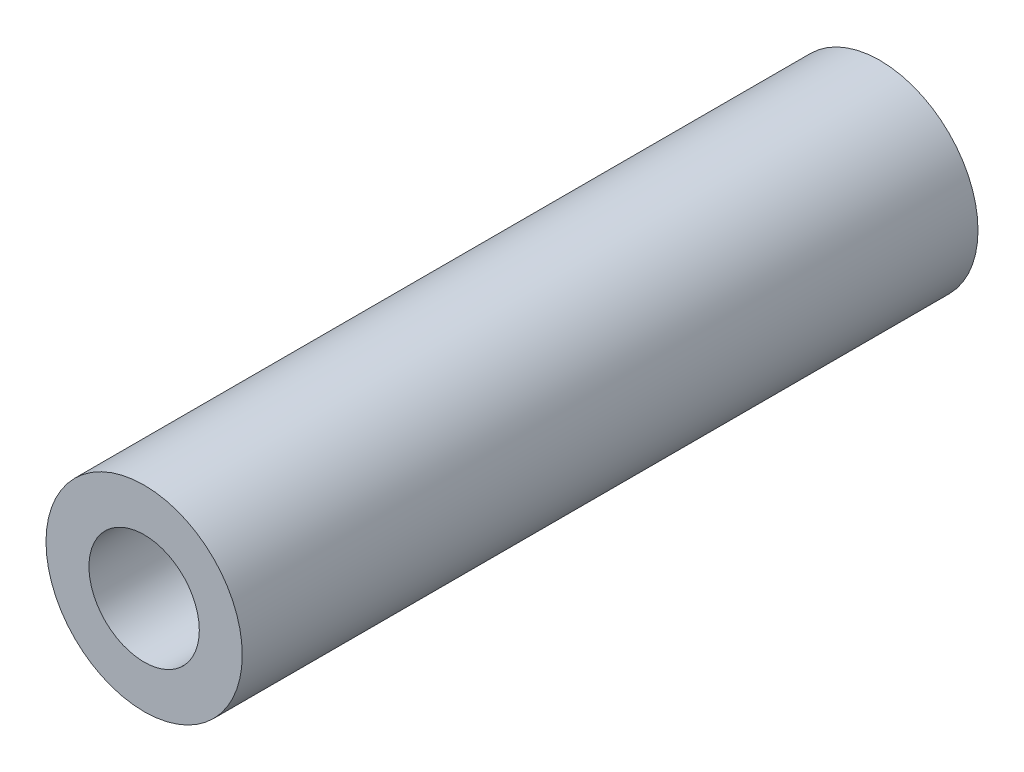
ISO-10303-21;
HEADER;
FILE_DESCRIPTION(('STEP AP214'),'2;1');
FILE_NAME('part.step','',(''),(''),'','','');
FILE_SCHEMA(('AUTOMOTIVE_DESIGN { 1 0 10303 214 1 1 1 1 }'));
ENDSEC;
DATA;
#1=APPLICATION_CONTEXT('core data for automotive mechanical design processes');
#2=APPLICATION_PROTOCOL_DEFINITION('international standard','automotive_design',2000,#1);
#3=PRODUCT_CONTEXT('',#1,'mechanical');
#4=PRODUCT('Part','Part','',(#3));
#5=PRODUCT_RELATED_PRODUCT_CATEGORY('part','',(#4));
#6=PRODUCT_DEFINITION_FORMATION('','',#4);
#7=PRODUCT_DEFINITION_CONTEXT('part definition',#1,'design');
#8=PRODUCT_DEFINITION('design','',#6,#7);
#9=PRODUCT_DEFINITION_SHAPE('','',#8);
#10=(LENGTH_UNIT() NAMED_UNIT(*) SI_UNIT(.MILLI.,.METRE.));
#11=(NAMED_UNIT(*) PLANE_ANGLE_UNIT() SI_UNIT($,.RADIAN.));
#12=(NAMED_UNIT(*) SI_UNIT($,.STERADIAN.) SOLID_ANGLE_UNIT());
#13=UNCERTAINTY_MEASURE_WITH_UNIT(LENGTH_MEASURE(1.E-05),#10,'distance_accuracy_value','');
#14=(GEOMETRIC_REPRESENTATION_CONTEXT(3) GLOBAL_UNCERTAINTY_ASSIGNED_CONTEXT((#13)) GLOBAL_UNIT_ASSIGNED_CONTEXT((#10,
#11,#12)) REPRESENTATION_CONTEXT('',''));
#15=CARTESIAN_POINT('',(0.,0.,0.));
#16=DIRECTION('',(0.,0.,1.));
#17=DIRECTION('',(1.,0.,0.));
#18=AXIS2_PLACEMENT_3D('',#15,#16,#17);
#19=CARTESIAN_POINT('',(0.,0.,50.8));
#20=DIRECTION('',(0.,0.,1.));
#21=DIRECTION('',(1.,0.,0.));
#22=AXIS2_PLACEMENT_3D('',#19,#20,#21);
#23=PLANE('',#22);
#24=CARTESIAN_POINT('',(0.,0.,50.8));
#25=DIRECTION('',(0.,0.,1.));
#26=DIRECTION('',(1.,0.,0.));
#27=AXIS2_PLACEMENT_3D('',#24,#25,#26);
#28=CIRCLE('',#27,6.77545);
#29=CARTESIAN_POINT('',(6.77545,0.,50.8));
#30=VERTEX_POINT('',#29);
#31=EDGE_CURVE('E10',#30,#30,#28,.T.);
#32=ORIENTED_EDGE('',*,*,#31,.T.);
#33=EDGE_LOOP('',(#32));
#34=FACE_BOUND('',#33,.T.);
#35=CARTESIAN_POINT('',(0.,0.,50.8));
#36=DIRECTION('',(0.,0.,1.));
#37=DIRECTION('',(1.,0.,0.));
#38=AXIS2_PLACEMENT_3D('',#35,#36,#37);
#39=CIRCLE('',#38,3.81);
#40=CARTESIAN_POINT('',(3.81,0.,50.8));
#41=VERTEX_POINT('',#40);
#42=EDGE_CURVE('E44',#41,#41,#39,.T.);
#43=ORIENTED_EDGE('',*,*,#42,.F.);
#44=EDGE_LOOP('',(#43));
#45=FACE_BOUND('',#44,.T.);
#46=ADVANCED_FACE('F33',(#34,#45),#23,.T.);
#47=CARTESIAN_POINT('',(0.,0.,0.));
#48=DIRECTION('',(0.,0.,1.));
#49=DIRECTION('',(1.,0.,0.));
#50=AXIS2_PLACEMENT_3D('',#47,#48,#49);
#51=PLANE('',#50);
#52=CARTESIAN_POINT('',(0.,0.,0.));
#53=DIRECTION('',(0.,0.,1.));
#54=DIRECTION('',(1.,0.,0.));
#55=AXIS2_PLACEMENT_3D('',#52,#53,#54);
#56=CIRCLE('',#55,6.77545);
#57=CARTESIAN_POINT('',(6.77545,0.,0.));
#58=VERTEX_POINT('',#57);
#59=EDGE_CURVE('E37',#58,#58,#56,.T.);
#60=ORIENTED_EDGE('',*,*,#59,.F.);
#61=EDGE_LOOP('',(#60));
#62=FACE_BOUND('',#61,.T.);
#63=CARTESIAN_POINT('',(0.,0.,0.));
#64=DIRECTION('',(0.,0.,1.));
#65=DIRECTION('',(1.,0.,0.));
#66=AXIS2_PLACEMENT_3D('',#63,#64,#65);
#67=CIRCLE('',#66,3.81);
#68=CARTESIAN_POINT('',(3.81,0.,0.));
#69=VERTEX_POINT('',#68);
#70=EDGE_CURVE('E46',#69,#69,#67,.T.);
#71=ORIENTED_EDGE('',*,*,#70,.T.);
#72=EDGE_LOOP('',(#71));
#73=FACE_BOUND('',#72,.T.);
#74=ADVANCED_FACE('F56',(#62,#73),#51,.F.);
#75=CARTESIAN_POINT('',(0.,0.,50.8));
#76=DIRECTION('',(0.,0.,-1.));
#77=DIRECTION('',(-1.,0.,0.));
#78=AXIS2_PLACEMENT_3D('',#75,#76,#77);
#79=CYLINDRICAL_SURFACE('',#78,6.77545);
#80=ORIENTED_EDGE('',*,*,#31,.F.);
#81=EDGE_LOOP('',(#80));
#82=FACE_BOUND('',#81,.T.);
#83=ORIENTED_EDGE('',*,*,#59,.T.);
#84=EDGE_LOOP('',(#83));
#85=FACE_BOUND('',#84,.T.);
#86=ADVANCED_FACE('F35',(#82,#85),#79,.T.);
#87=CARTESIAN_POINT('',(0.,0.,50.8));
#88=DIRECTION('',(0.,0.,-1.));
#89=DIRECTION('',(-1.,0.,0.));
#90=AXIS2_PLACEMENT_3D('',#87,#88,#89);
#91=CYLINDRICAL_SURFACE('',#90,3.81);
#92=ORIENTED_EDGE('',*,*,#42,.T.);
#93=EDGE_LOOP('',(#92));
#94=FACE_BOUND('',#93,.T.);
#95=ORIENTED_EDGE('',*,*,#70,.F.);
#96=EDGE_LOOP('',(#95));
#97=FACE_BOUND('',#96,.T.);
#98=ADVANCED_FACE('F52',(#94,#97),#91,.F.);
#99=CLOSED_SHELL('',(#46,#74,#86,#98));
#100=MANIFOLD_SOLID_BREP('B2',#99);
#101=ADVANCED_BREP_SHAPE_REPRESENTATION('',(#18,#100),#14);
#102=SHAPE_DEFINITION_REPRESENTATION(#9,#101);
ENDSEC;
END-ISO-10303-21;
